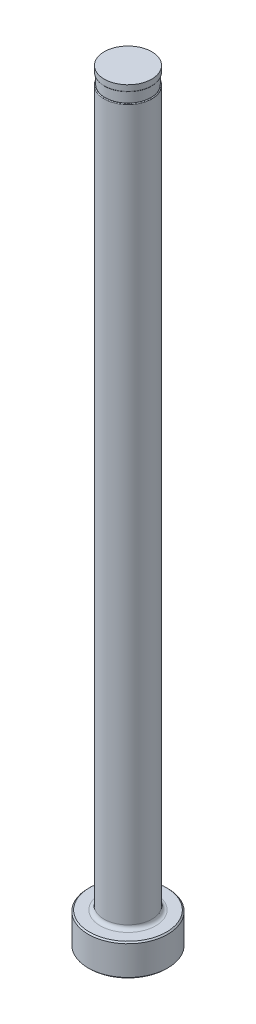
ISO-10303-21;
HEADER;
FILE_DESCRIPTION(('STEP AP214'),'2;1');
FILE_NAME('part.step','',(''),(''),'','','');
FILE_SCHEMA(('AUTOMOTIVE_DESIGN { 1 0 10303 214 1 1 1 1 }'));
ENDSEC;
DATA;
#1=APPLICATION_CONTEXT('core data for automotive mechanical design processes');
#2=APPLICATION_PROTOCOL_DEFINITION('international standard','automotive_design',2000,#1);
#3=PRODUCT_CONTEXT('',#1,'mechanical');
#4=PRODUCT('Part','Part','',(#3));
#5=PRODUCT_RELATED_PRODUCT_CATEGORY('part','',(#4));
#6=PRODUCT_DEFINITION_FORMATION('','',#4);
#7=PRODUCT_DEFINITION_CONTEXT('part definition',#1,'design');
#8=PRODUCT_DEFINITION('design','',#6,#7);
#9=PRODUCT_DEFINITION_SHAPE('','',#8);
#10=(LENGTH_UNIT() NAMED_UNIT(*) SI_UNIT(.MILLI.,.METRE.));
#11=(NAMED_UNIT(*) PLANE_ANGLE_UNIT() SI_UNIT($,.RADIAN.));
#12=(NAMED_UNIT(*) SI_UNIT($,.STERADIAN.) SOLID_ANGLE_UNIT());
#13=UNCERTAINTY_MEASURE_WITH_UNIT(LENGTH_MEASURE(1.E-05),#10,'distance_accuracy_value','');
#14=(GEOMETRIC_REPRESENTATION_CONTEXT(3) GLOBAL_UNCERTAINTY_ASSIGNED_CONTEXT((#13)) GLOBAL_UNIT_ASSIGNED_CONTEXT((#10,
#11,#12)) REPRESENTATION_CONTEXT('',''));
#15=CARTESIAN_POINT('',(0.,0.,0.));
#16=DIRECTION('',(0.,0.,1.));
#17=DIRECTION('',(1.,0.,0.));
#18=AXIS2_PLACEMENT_3D('',#15,#16,#17);
#19=CARTESIAN_POINT('',(-4.76249999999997,151.13,0.));
#20=DIRECTION('',(0.,1.,0.));
#21=DIRECTION('',(0.,0.,1.));
#22=AXIS2_PLACEMENT_3D('',#19,#20,#21);
#23=PLANE('',#22);
#24=CARTESIAN_POINT('',(0.,151.13,0.));
#25=DIRECTION('',(0.,1.,0.));
#26=DIRECTION('',(0.,0.,1.));
#27=AXIS2_PLACEMENT_3D('',#24,#25,#26);
#28=CIRCLE('',#27,4.61644999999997);
#29=CARTESIAN_POINT('',(0.,151.13,4.61644999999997));
#30=VERTEX_POINT('',#29);
#31=EDGE_CURVE('E11',#30,#30,#28,.F.);
#32=ORIENTED_EDGE('',*,*,#31,.T.);
#33=EDGE_LOOP('',(#32));
#34=FACE_BOUND('',#33,.T.);
#35=CARTESIAN_POINT('',(0.,151.13,0.));
#36=DIRECTION('',(0.,1.,0.));
#37=DIRECTION('',(0.,0.,1.));
#38=AXIS2_PLACEMENT_3D('',#35,#36,#37);
#39=CIRCLE('',#38,4.55929999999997);
#40=CARTESIAN_POINT('',(0.,151.13,4.55929999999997));
#41=VERTEX_POINT('',#40);
#42=EDGE_CURVE('E78',#41,#41,#39,.T.);
#43=ORIENTED_EDGE('',*,*,#42,.T.);
#44=EDGE_LOOP('',(#43));
#45=FACE_BOUND('',#44,.T.);
#46=ADVANCED_FACE('F36',(#34,#45),#23,.F.);
#47=CARTESIAN_POINT('',(0.,259.958771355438,0.));
#48=DIRECTION('',(0.,1.,0.));
#49=DIRECTION('',(0.,0.,1.));
#50=AXIS2_PLACEMENT_3D('',#47,#48,#49);
#51=CYLINDRICAL_SURFACE('',#50,4.76249999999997);
#52=DIRECTION('',(0.,1.,0.));
#53=VECTOR('',#52,1.);
#54=CARTESIAN_POINT('',(-4.55929999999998,259.958771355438,-1.37629566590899));
#55=LINE('',#54,#53);
#56=CARTESIAN_POINT('',(-4.55929999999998,148.971,-1.37629566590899));
#57=VERTEX_POINT('',#56);
#58=CARTESIAN_POINT('',(-4.55929999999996,86.614,-1.37629566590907));
#59=VERTEX_POINT('',#58);
#60=EDGE_CURVE('E73',#57,#59,#55,.F.);
#61=ORIENTED_EDGE('',*,*,#60,.F.);
#62=CARTESIAN_POINT('',(0.,148.971,0.));
#63=DIRECTION('',(0.,-1.,0.));
#64=DIRECTION('',(0.,0.,-1.));
#65=AXIS2_PLACEMENT_3D('',#62,#63,#64);
#66=CIRCLE('',#65,4.76249999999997);
#67=CARTESIAN_POINT('',(-4.55929999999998,148.971,1.37629566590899));
#68=VERTEX_POINT('',#67);
#69=EDGE_CURVE('E51',#57,#68,#66,.T.);
#70=ORIENTED_EDGE('',*,*,#69,.T.);
#71=DIRECTION('',(0.,1.,0.));
#72=VECTOR('',#71,1.);
#73=CARTESIAN_POINT('',(-4.55929999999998,259.958771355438,1.37629566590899));
#74=LINE('',#73,#72);
#75=CARTESIAN_POINT('',(-4.55929999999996,86.614,1.37629566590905));
#76=VERTEX_POINT('',#75);
#77=EDGE_CURVE('E84',#76,#68,#74,.T.);
#78=ORIENTED_EDGE('',*,*,#77,.F.);
#79=CARTESIAN_POINT('',(-4.55929999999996,86.614,-1.37629566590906));
#80=CARTESIAN_POINT('',(-4.55929737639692,86.5852402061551,-1.37629775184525));
#81=CARTESIAN_POINT('',(-4.55969127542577,86.5564975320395,-1.37500007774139));
#82=CARTESIAN_POINT('',(-4.56124470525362,86.4992773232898,-1.36984087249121));
#83=CARTESIAN_POINT('',(-4.5624038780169,86.4707996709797,-1.36598054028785));
#84=CARTESIAN_POINT('',(-4.56696801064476,86.3864539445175,-1.35067685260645));
#85=CARTESIAN_POINT('',(-4.5714603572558,86.3312762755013,-1.33550964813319));
#86=CARTESIAN_POINT('',(-4.58280020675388,86.2246988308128,-1.29605614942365));
#87=CARTESIAN_POINT('',(-4.58964466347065,86.1732942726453,-1.27178164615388));
#88=CARTESIAN_POINT('',(-4.60493832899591,86.0753127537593,-1.2152383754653));
#89=CARTESIAN_POINT('',(-4.61338924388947,86.0287410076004,-1.18296109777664));
#90=CARTESIAN_POINT('',(-4.63119432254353,85.9406407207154,-1.11122717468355));
#91=CARTESIAN_POINT('',(-4.64055936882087,85.8991909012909,-1.07167734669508));
#92=CARTESIAN_POINT('',(-4.65929799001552,85.8224511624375,-0.987030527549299));
#93=CARTESIAN_POINT('',(-4.66867156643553,85.7871627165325,-0.941932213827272));
#94=CARTESIAN_POINT('',(-4.68829944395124,85.7173161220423,-0.839298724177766));
#95=CARTESIAN_POINT('',(-4.69843056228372,85.6839130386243,-0.780955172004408));
#96=CARTESIAN_POINT('',(-4.71694909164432,85.6254876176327,-0.659965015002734));
#97=CARTESIAN_POINT('',(-4.72533534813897,85.6004708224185,-0.597315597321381));
#98=CARTESIAN_POINT('',(-4.74110178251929,85.5547147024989,-0.457354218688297));
#99=CARTESIAN_POINT('',(-4.74801655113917,85.5355974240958,-0.379457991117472));
#100=CARTESIAN_POINT('',(-4.75800499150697,85.5083334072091,-0.221524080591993));
#101=CARTESIAN_POINT('',(-4.76107621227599,85.500193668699,-0.141485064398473));
#102=CARTESIAN_POINT('',(-4.76327668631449,85.4943271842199,0.0299431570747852));
#103=CARTESIAN_POINT('',(-4.76181415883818,85.4981641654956,0.121398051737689));
#104=CARTESIAN_POINT('',(-4.75374911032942,85.5198915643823,0.302489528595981));
#105=CARTESIAN_POINT('',(-4.74714208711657,85.5377942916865,0.392124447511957));
#106=CARTESIAN_POINT('',(-4.72930079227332,85.5886459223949,0.568426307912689));
#107=CARTESIAN_POINT('',(-4.71798291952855,85.6218679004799,0.655007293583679));
#108=CARTESIAN_POINT('',(-4.69215822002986,85.7041393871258,0.819736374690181));
#109=CARTESIAN_POINT('',(-4.67765906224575,85.7531509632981,0.897904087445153));
#110=CARTESIAN_POINT('',(-4.65260917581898,85.8488873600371,1.01840460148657));
#111=CARTESIAN_POINT('',(-4.642278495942,85.8913315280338,1.06420330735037));
#112=CARTESIAN_POINT('',(-4.62221244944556,85.9833278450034,1.14822353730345));
#113=CARTESIAN_POINT('',(-4.61247679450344,86.0328765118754,1.18644875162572));
#114=CARTESIAN_POINT('',(-4.59462030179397,86.1386759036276,1.2538357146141));
#115=CARTESIAN_POINT('',(-4.58651300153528,86.1949770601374,1.28292253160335));
#116=CARTESIAN_POINT('',(-4.57311393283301,86.312357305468,1.3299034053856));
#117=CARTESIAN_POINT('',(-4.56781667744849,86.373426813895,1.34781928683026));
#118=CARTESIAN_POINT('',(-4.56265822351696,86.4650432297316,1.36513201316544));
#119=CARTESIAN_POINT('',(-4.5614036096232,86.4946738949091,1.36931216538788));
#120=CARTESIAN_POINT('',(-4.55972347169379,86.5541961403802,1.37489368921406));
#121=CARTESIAN_POINT('',(-4.55929732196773,86.584087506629,1.37629715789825));
#122=CARTESIAN_POINT('',(-4.55929999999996,86.614,1.37629566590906));
#123=B_SPLINE_CURVE_WITH_KNOTS('',3,(#79,#80,#81,#82,#83,#84,#85,#86,#87,#88,#89,#90,#91,#92,
#93,#94,#95,#96,#97,#98,#99,#100,#101,#102,#103,#104,#105,#106,#107,#108,#109,#110,#111,#112,
#113,#114,#115,#116,#117,#118,#119,#120,#121,#122),.UNSPECIFIED.,.F.,.F.,(4,2,2,2,2,2,2,2,2,2,2,
2,2,2,2,2,2,2,2,2,2,4),(0.,0.086214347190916,0.172388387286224,0.343564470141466,
0.514519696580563,0.685657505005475,0.859163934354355,1.03271180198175,1.23591349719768,
1.43924922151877,1.67981780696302,1.92053972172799,2.1939427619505,2.4675853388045,
2.74630643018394,3.02436286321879,3.21350217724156,3.40254910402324,3.59310796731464,
3.78329335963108,3.87302183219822,3.9626825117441),.UNSPECIFIED.);
#124=EDGE_CURVE('E81',#59,#76,#123,.T.);
#125=ORIENTED_EDGE('',*,*,#124,.F.);
#126=EDGE_LOOP('',(#61,#70,#78,#125));
#127=FACE_BOUND('',#126,.T.);
#128=CARTESIAN_POINT('',(0.,7.11200000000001,0.));
#129=DIRECTION('',(0.,1.,0.));
#130=DIRECTION('',(0.,0.,1.));
#131=AXIS2_PLACEMENT_3D('',#128,#129,#130);
#132=CIRCLE('',#131,4.76249999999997);
#133=CARTESIAN_POINT('',(0.,7.11200000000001,4.76249999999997));
#134=VERTEX_POINT('',#133);
#135=EDGE_CURVE('E116',#134,#134,#132,.T.);
#136=ORIENTED_EDGE('',*,*,#135,.T.);
#137=EDGE_LOOP('',(#136));
#138=FACE_BOUND('',#137,.T.);
#139=ADVANCED_FACE('F82',(#127,#138),#51,.T.);
#140=CARTESIAN_POINT('',(0.,0.,0.));
#141=DIRECTION('',(0.,-1.,0.));
#142=DIRECTION('',(0.,0.,-1.));
#143=AXIS2_PLACEMENT_3D('',#140,#141,#142);
#144=PLANE('',#143);
#145=CARTESIAN_POINT('',(0.,0.,0.));
#146=DIRECTION('',(0.,-1.,0.));
#147=DIRECTION('',(0.,0.,-1.));
#148=AXIS2_PLACEMENT_3D('',#145,#146,#147);
#149=CIRCLE('',#148,7.68349999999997);
#150=CARTESIAN_POINT('',(0.,0.,-7.68349999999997));
#151=VERTEX_POINT('',#150);
#152=EDGE_CURVE('E113',#151,#151,#149,.T.);
#153=ORIENTED_EDGE('',*,*,#152,.T.);
#154=EDGE_LOOP('',(#153));
#155=FACE_BOUND('',#154,.T.);
#156=ADVANCED_FACE('F192',(#155),#144,.T.);
#157=CARTESIAN_POINT('',(0.,259.958771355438,0.));
#158=DIRECTION('',(0.,1.,0.));
#159=DIRECTION('',(0.,0.,1.));
#160=AXIS2_PLACEMENT_3D('',#157,#158,#159);
#161=CYLINDRICAL_SURFACE('',#160,7.93749999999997);
#162=CARTESIAN_POINT('',(0.,6.09600000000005,0.));
#163=DIRECTION('',(0.,1.,0.));
#164=DIRECTION('',(0.,0.,1.));
#165=AXIS2_PLACEMENT_3D('',#162,#163,#164);
#166=CIRCLE('',#165,7.93749999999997);
#167=CARTESIAN_POINT('',(0.,6.09600000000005,7.93749999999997));
#168=VERTEX_POINT('',#167);
#169=EDGE_CURVE('E110',#168,#168,#166,.F.);
#170=ORIENTED_EDGE('',*,*,#169,.T.);
#171=EDGE_LOOP('',(#170));
#172=FACE_BOUND('',#171,.T.);
#173=CARTESIAN_POINT('',(0.,0.253999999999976,0.));
#174=DIRECTION('',(0.,-1.,0.));
#175=DIRECTION('',(0.,0.,-1.));
#176=AXIS2_PLACEMENT_3D('',#173,#174,#175);
#177=CIRCLE('',#176,7.93749999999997);
#178=CARTESIAN_POINT('',(0.,0.253999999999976,-7.93749999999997));
#179=VERTEX_POINT('',#178);
#180=EDGE_CURVE('E107',#179,#179,#177,.F.);
#181=ORIENTED_EDGE('',*,*,#180,.T.);
#182=EDGE_LOOP('',(#181));
#183=FACE_BOUND('',#182,.T.);
#184=ADVANCED_FACE('F195',(#172,#183),#161,.T.);
#185=CARTESIAN_POINT('',(-7.93749999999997,6.35,0.));
#186=DIRECTION('',(0.,1.,0.));
#187=DIRECTION('',(0.,0.,1.));
#188=AXIS2_PLACEMENT_3D('',#185,#186,#187);
#189=PLANE('',#188);
#190=CARTESIAN_POINT('',(0.,6.35,0.));
#191=DIRECTION('',(0.,1.,0.));
#192=DIRECTION('',(0.,0.,1.));
#193=AXIS2_PLACEMENT_3D('',#190,#191,#192);
#194=CIRCLE('',#193,5.52449999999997);
#195=CARTESIAN_POINT('',(0.,6.35,5.52449999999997));
#196=VERTEX_POINT('',#195);
#197=EDGE_CURVE('E87',#196,#196,#194,.F.);
#198=ORIENTED_EDGE('',*,*,#197,.T.);
#199=EDGE_LOOP('',(#198));
#200=FACE_BOUND('',#199,.T.);
#201=CARTESIAN_POINT('',(0.,6.35,0.));
#202=DIRECTION('',(0.,1.,0.));
#203=DIRECTION('',(0.,0.,1.));
#204=AXIS2_PLACEMENT_3D('',#201,#202,#203);
#205=CIRCLE('',#204,7.68350000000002);
#206=CARTESIAN_POINT('',(0.,6.35,7.68350000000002));
#207=VERTEX_POINT('',#206);
#208=EDGE_CURVE('E104',#207,#207,#205,.T.);
#209=ORIENTED_EDGE('',*,*,#208,.T.);
#210=EDGE_LOOP('',(#209));
#211=FACE_BOUND('',#210,.T.);
#212=ADVANCED_FACE('F190',(#200,#211),#189,.T.);
#213=CARTESIAN_POINT('',(0.,6.35000000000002,0.));
#214=DIRECTION('',(0.,-1.,0.));
#215=DIRECTION('',(0.,0.,-1.));
#216=AXIS2_PLACEMENT_3D('',#213,#214,#215);
#217=CONICAL_SURFACE('',#216,7.6835,0.785398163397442);
#218=ORIENTED_EDGE('',*,*,#169,.F.);
#219=EDGE_LOOP('',(#218));
#220=FACE_BOUND('',#219,.T.);
#221=ORIENTED_EDGE('',*,*,#208,.F.);
#222=EDGE_LOOP('',(#221));
#223=FACE_BOUND('',#222,.T.);
#224=ADVANCED_FACE('F186',(#220,#223),#217,.T.);
#225=CARTESIAN_POINT('',(0.,0.253999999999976,0.));
#226=DIRECTION('',(0.,1.,0.));
#227=DIRECTION('',(0.,0.,1.));
#228=AXIS2_PLACEMENT_3D('',#225,#226,#227);
#229=CONICAL_SURFACE('',#228,7.93749999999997,0.785398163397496);
#230=ORIENTED_EDGE('',*,*,#152,.F.);
#231=EDGE_LOOP('',(#230));
#232=FACE_BOUND('',#231,.T.);
#233=ORIENTED_EDGE('',*,*,#180,.F.);
#234=EDGE_LOOP('',(#233));
#235=FACE_BOUND('',#234,.T.);
#236=ADVANCED_FACE('F182',(#232,#235),#229,.T.);
#237=CARTESIAN_POINT('',(0.,7.11200000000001,0.));
#238=DIRECTION('',(0.,1.,0.));
#239=DIRECTION('',(0.,0.,1.));
#240=AXIS2_PLACEMENT_3D('',#237,#238,#239);
#241=TOROIDAL_SURFACE('',#240,5.52449999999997,0.762);
#242=ORIENTED_EDGE('',*,*,#197,.F.);
#243=EDGE_LOOP('',(#242));
#244=FACE_BOUND('',#243,.T.);
#245=ORIENTED_EDGE('',*,*,#135,.F.);
#246=EDGE_LOOP('',(#245));
#247=FACE_BOUND('',#246,.T.);
#248=ADVANCED_FACE('F147',(#244,#247),#241,.F.);
#249=CARTESIAN_POINT('',(-4.76249999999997,149.098,0.));
#250=DIRECTION('',(0.,-1.,0.));
#251=DIRECTION('',(0.,0.,-1.));
#252=AXIS2_PLACEMENT_3D('',#249,#250,#251);
#253=PLANE('',#252);
#254=DIRECTION('',(0.,0.,1.));
#255=VECTOR('',#254,1.);
#256=CARTESIAN_POINT('',(-4.55929999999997,149.098,0.));
#257=LINE('',#256,#255);
#258=CARTESIAN_POINT('',(-4.55929999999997,149.098,0.));
#259=VERTEX_POINT('',#258);
#260=CARTESIAN_POINT('',(-4.55929999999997,149.098,0.837044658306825));
#261=VERTEX_POINT('',#260);
#262=EDGE_CURVE('E90',#259,#261,#257,.T.);
#263=ORIENTED_EDGE('',*,*,#262,.T.);
#264=CARTESIAN_POINT('',(0.,149.098,0.));
#265=DIRECTION('',(0.,-1.,0.));
#266=DIRECTION('',(0.,0.,-1.));
#267=AXIS2_PLACEMENT_3D('',#264,#265,#266);
#268=CIRCLE('',#267,4.63549999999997);
#269=CARTESIAN_POINT('',(-4.55929999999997,149.098,-0.837044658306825));
#270=VERTEX_POINT('',#269);
#271=EDGE_CURVE('E86',#261,#270,#268,.F.);
#272=ORIENTED_EDGE('',*,*,#271,.T.);
#273=EDGE_CURVE('E79',#270,#259,#257,.T.);
#274=ORIENTED_EDGE('',*,*,#273,.T.);
#275=CARTESIAN_POINT('',(0.,149.098,0.));
#276=DIRECTION('',(0.,1.,0.));
#277=DIRECTION('',(0.,0.,1.));
#278=AXIS2_PLACEMENT_3D('',#275,#276,#277);
#279=CIRCLE('',#278,4.55929999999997);
#280=EDGE_CURVE('E101',#259,#259,#279,.T.);
#281=ORIENTED_EDGE('',*,*,#280,.F.);
#282=EDGE_LOOP('',(#263,#272,#274,#281));
#283=FACE_BOUND('',#282,.T.);
#284=ADVANCED_FACE('F144',(#283),#253,.F.);
#285=CARTESIAN_POINT('',(0.,153.448281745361,0.));
#286=DIRECTION('',(0.,1.,0.));
#287=DIRECTION('',(0.,0.,1.));
#288=AXIS2_PLACEMENT_3D('',#285,#286,#287);
#289=CYLINDRICAL_SURFACE('',#288,4.55929999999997);
#290=ORIENTED_EDGE('',*,*,#42,.F.);
#291=EDGE_LOOP('',(#290));
#292=FACE_BOUND('',#291,.T.);
#293=ORIENTED_EDGE('',*,*,#280,.T.);
#294=EDGE_LOOP('',(#293));
#295=FACE_BOUND('',#294,.T.);
#296=ADVANCED_FACE('F141',(#292,#295),#289,.T.);
#297=CARTESIAN_POINT('',(-4.55929999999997,150.114,-7.93749999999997));
#298=DIRECTION('',(1.,0.,0.));
#299=DIRECTION('',(0.,1.,0.));
#300=AXIS2_PLACEMENT_3D('',#297,#298,#299);
#301=PLANE('',#300);
#302=ORIENTED_EDGE('',*,*,#273,.F.);
#303=CARTESIAN_POINT('',(-4.55929999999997,149.098,-0.837044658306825));
#304=CARTESIAN_POINT('',(-4.55929999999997,149.097996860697,-0.858041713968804));
#305=CARTESIAN_POINT('',(-4.55929999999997,149.097829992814,-0.879040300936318));
#306=CARTESIAN_POINT('',(-4.55929999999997,149.097073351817,-0.921044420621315));
#307=CARTESIAN_POINT('',(-4.55929999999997,149.096483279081,-0.942049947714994));
#308=CARTESIAN_POINT('',(-4.55929999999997,149.094769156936,-0.984421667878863));
#309=CARTESIAN_POINT('',(-4.55929999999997,149.093635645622,-1.00578751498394));
#310=CARTESIAN_POINT('',(-4.55929999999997,149.090687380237,-1.04846310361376));
#311=CARTESIAN_POINT('',(-4.55929999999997,149.088872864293,-1.06977286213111));
#312=CARTESIAN_POINT('',(-4.55929999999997,149.083360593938,-1.12201635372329));
#313=CARTESIAN_POINT('',(-4.55929999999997,149.079181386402,-1.15290757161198));
#314=CARTESIAN_POINT('',(-4.55929999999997,149.070757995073,-1.19875333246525));
#315=CARTESIAN_POINT('',(-4.55929999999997,149.067604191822,-1.21390713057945));
#316=CARTESIAN_POINT('',(-4.55929999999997,149.06032624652,-1.24397628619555));
#317=CARTESIAN_POINT('',(-4.55929999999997,149.056203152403,-1.25889188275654));
#318=CARTESIAN_POINT('',(-4.55929999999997,149.049136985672,-1.28034672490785));
#319=CARTESIAN_POINT('',(-4.55929999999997,149.046754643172,-1.28707008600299));
#320=CARTESIAN_POINT('',(-4.55929999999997,149.041598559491,-1.30038917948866));
#321=CARTESIAN_POINT('',(-4.55929999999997,149.038823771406,-1.30698451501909));
#322=CARTESIAN_POINT('',(-4.55929999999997,149.032425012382,-1.32070015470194));
#323=CARTESIAN_POINT('',(-4.55929999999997,149.028739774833,-1.32779211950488));
#324=CARTESIAN_POINT('',(-4.55929999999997,149.020505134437,-1.34145187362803));
#325=CARTESIAN_POINT('',(-4.55929999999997,149.015959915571,-1.34802199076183));
#326=CARTESIAN_POINT('',(-4.55929999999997,149.008707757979,-1.3564128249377));
#327=CARTESIAN_POINT('',(-4.55929999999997,149.006550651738,-1.35870356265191));
#328=CARTESIAN_POINT('',(-4.55929999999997,149.001986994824,-1.36303580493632));
#329=CARTESIAN_POINT('',(-4.55929999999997,148.999580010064,-1.36507686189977));
#330=CARTESIAN_POINT('',(-4.55929999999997,148.994447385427,-1.36882028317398));
#331=CARTESIAN_POINT('',(-4.55929999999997,148.99171711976,-1.37051646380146));
#332=CARTESIAN_POINT('',(-4.55929999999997,148.985982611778,-1.37333747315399));
#333=CARTESIAN_POINT('',(-4.55929999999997,148.982980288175,-1.37446598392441));
#334=CARTESIAN_POINT('',(-4.55929999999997,148.978439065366,-1.37556999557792));
#335=CARTESIAN_POINT('',(-4.55929999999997,148.976969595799,-1.37583954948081));
#336=CARTESIAN_POINT('',(-4.55929999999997,148.974000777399,-1.37620343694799));
#337=CARTESIAN_POINT('',(-4.55929999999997,148.972501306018,-1.3762967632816));
#338=CARTESIAN_POINT('',(-4.55929999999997,148.971,-1.37629566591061));
#339=B_SPLINE_CURVE_WITH_KNOTS('',3,(#303,#304,#305,#306,#307,#308,#309,#310,#311,#312,#313,
#314,#315,#316,#317,#318,#319,#320,#321,#322,#323,#324,#325,#326,#327,#328,#329,#330,#331,#332,
#333,#334,#335,#336,#337,#338),.UNSPECIFIED.,.F.,.F.,(4,2,2,2,2,2,2,2,2,2,2,2,2,2,2,2,2,4),(0.,
0.0629926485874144,0.126029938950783,0.190207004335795,0.254361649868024,0.347770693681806,
0.394187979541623,0.440555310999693,0.461946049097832,0.483394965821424,0.507342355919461,
0.531176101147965,0.540601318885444,0.550043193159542,0.559641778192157,0.56917727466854,
0.573649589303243,0.578147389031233),.UNSPECIFIED.);
#340=EDGE_CURVE('E59',#270,#57,#339,.T.);
#341=ORIENTED_EDGE('',*,*,#340,.T.);
#342=ORIENTED_EDGE('',*,*,#60,.T.);
#343=DIRECTION('',(0.,0.,1.));
#344=VECTOR('',#343,1.);
#345=CARTESIAN_POINT('',(-4.55929999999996,86.614,-7.93749999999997));
#346=LINE('',#345,#344);
#347=EDGE_CURVE('E77',#59,#76,#346,.T.);
#348=ORIENTED_EDGE('',*,*,#347,.T.);
#349=ORIENTED_EDGE('',*,*,#77,.T.);
#350=CARTESIAN_POINT('',(-4.55929999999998,148.971,1.37629566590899));
#351=CARTESIAN_POINT('',(-4.55929999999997,148.973444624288,1.3763038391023));
#352=CARTESIAN_POINT('',(-4.55929999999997,148.975877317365,1.37605183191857));
#353=CARTESIAN_POINT('',(-4.55929999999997,148.980619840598,1.37510642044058));
#354=CARTESIAN_POINT('',(-4.55929999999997,148.982930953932,1.37441958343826));
#355=CARTESIAN_POINT('',(-4.55929999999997,148.987943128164,1.37247105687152));
#356=CARTESIAN_POINT('',(-4.55929999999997,148.990605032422,1.3711110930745));
#357=CARTESIAN_POINT('',(-4.55929999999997,148.995689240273,1.36798215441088));
#358=CARTESIAN_POINT('',(-4.55929999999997,148.998109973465,1.36621072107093));
#359=CARTESIAN_POINT('',(-4.55929999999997,149.004401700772,1.36098866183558));
#360=CARTESIAN_POINT('',(-4.55929999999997,149.0080371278,1.35725807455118));
#361=CARTESIAN_POINT('',(-4.55929999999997,149.014750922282,1.34933701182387));
#362=CARTESIAN_POINT('',(-4.55929999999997,149.017828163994,1.34514563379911));
#363=CARTESIAN_POINT('',(-4.55929999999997,149.029141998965,1.32813171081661));
#364=CARTESIAN_POINT('',(-4.55929999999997,149.035833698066,1.31430846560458));
#365=CARTESIAN_POINT('',(-4.55929999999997,149.047426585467,1.28593719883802));
#366=CARTESIAN_POINT('',(-4.55929999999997,149.052315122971,1.27138484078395));
#367=CARTESIAN_POINT('',(-4.55929999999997,149.060580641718,1.24300288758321));
#368=CARTESIAN_POINT('',(-4.55929999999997,149.064042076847,1.22919836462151));
#369=CARTESIAN_POINT('',(-4.55929999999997,149.070216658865,1.20142059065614));
#370=CARTESIAN_POINT('',(-4.55929999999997,149.072929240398,1.18744722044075));
#371=CARTESIAN_POINT('',(-4.55929999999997,149.080216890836,1.14532367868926));
#372=CARTESIAN_POINT('',(-4.55929999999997,149.08392779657,1.11702450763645));
#373=CARTESIAN_POINT('',(-4.55929999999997,149.089831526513,1.06027711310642));
#374=CARTESIAN_POINT('',(-4.55929999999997,149.092023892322,1.031828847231));
#375=CARTESIAN_POINT('',(-4.55929999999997,149.095305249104,0.974900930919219));
#376=CARTESIAN_POINT('',(-4.55929999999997,149.096395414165,0.946421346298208));
#377=CARTESIAN_POINT('',(-4.55929999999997,149.097399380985,0.904435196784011));
#378=CARTESIAN_POINT('',(-4.55929999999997,149.097630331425,0.890934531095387));
#379=CARTESIAN_POINT('',(-4.55929999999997,149.097930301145,0.863970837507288));
#380=CARTESIAN_POINT('',(-4.55929999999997,149.097999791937,0.85050781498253));
#381=CARTESIAN_POINT('',(-4.55929999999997,149.098,0.837044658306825));
#382=B_SPLINE_CURVE_WITH_KNOTS('',3,(#350,#351,#352,#353,#354,#355,#356,#357,#358,#359,#360,
#361,#362,#363,#364,#365,#366,#367,#368,#369,#370,#371,#372,#373,#374,#375,#376,#377,#378,#379,
#380,#381),.UNSPECIFIED.,.F.,.F.,(4,2,2,2,2,2,2,2,2,2,2,2,2,2,2,4),(0.,0.00730179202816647,
0.0144958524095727,0.0234127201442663,0.0323843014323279,0.0479233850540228,0.0634934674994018,
0.109206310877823,0.155234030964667,0.197892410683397,0.240582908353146,0.32613198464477,
0.411706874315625,0.497190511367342,0.537697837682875,0.578086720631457),.UNSPECIFIED.);
#383=EDGE_CURVE('E172',#68,#261,#382,.T.);
#384=ORIENTED_EDGE('',*,*,#383,.T.);
#385=ORIENTED_EDGE('',*,*,#262,.F.);
#386=EDGE_LOOP('',(#302,#341,#342,#348,#349,#384,#385));
#387=FACE_BOUND('',#386,.T.);
#388=ADVANCED_FACE('F75',(#387),#301,.F.);
#389=CARTESIAN_POINT('',(-7.73429999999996,86.614,-7.93749999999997));
#390=DIRECTION('',(0.,0.,1.));
#391=DIRECTION('',(1.,0.,0.));
#392=AXIS2_PLACEMENT_3D('',#389,#390,#391);
#393=CYLINDRICAL_SURFACE('',#392,3.175);
#394=ORIENTED_EDGE('',*,*,#347,.F.);
#395=ORIENTED_EDGE('',*,*,#124,.T.);
#396=EDGE_LOOP('',(#394,#395));
#397=FACE_BOUND('',#396,.T.);
#398=ADVANCED_FACE('F89',(#397),#393,.F.);
#399=CARTESIAN_POINT('',(0.,152.687735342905,0.));
#400=DIRECTION('',(0.,1.,0.));
#401=DIRECTION('',(0.,0.,1.));
#402=AXIS2_PLACEMENT_3D('',#399,#400,#401);
#403=CYLINDRICAL_SURFACE('',#402,4.74344999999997);
#404=CARTESIAN_POINT('',(0.,151.257,0.));
#405=DIRECTION('',(0.,1.,0.));
#406=DIRECTION('',(0.,0.,1.));
#407=AXIS2_PLACEMENT_3D('',#404,#405,#406);
#408=CIRCLE('',#407,4.74344999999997);
#409=CARTESIAN_POINT('',(0.,151.257,4.74344999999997));
#410=VERTEX_POINT('',#409);
#411=EDGE_CURVE('E44',#410,#410,#408,.T.);
#412=ORIENTED_EDGE('',*,*,#411,.T.);
#413=EDGE_LOOP('',(#412));
#414=FACE_BOUND('',#413,.T.);
#415=CARTESIAN_POINT('',(0.,152.4,0.));
#416=DIRECTION('',(0.,1.,0.));
#417=DIRECTION('',(0.,0.,1.));
#418=AXIS2_PLACEMENT_3D('',#415,#416,#417);
#419=CIRCLE('',#418,4.74344999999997);
#420=CARTESIAN_POINT('',(0.,152.4,4.74344999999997));
#421=VERTEX_POINT('',#420);
#422=EDGE_CURVE('E91',#421,#421,#419,.T.);
#423=ORIENTED_EDGE('',*,*,#422,.F.);
#424=EDGE_LOOP('',(#423));
#425=FACE_BOUND('',#424,.T.);
#426=ADVANCED_FACE('F135',(#414,#425),#403,.T.);
#427=CARTESIAN_POINT('',(-4.76249999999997,152.4,0.));
#428=DIRECTION('',(0.,1.,0.));
#429=DIRECTION('',(0.,0.,1.));
#430=AXIS2_PLACEMENT_3D('',#427,#428,#429);
#431=PLANE('',#430);
#432=ORIENTED_EDGE('',*,*,#422,.T.);
#433=EDGE_LOOP('',(#432));
#434=FACE_BOUND('',#433,.T.);
#435=ADVANCED_FACE('F149',(#434),#431,.T.);
#436=CARTESIAN_POINT('',(0.,148.971,0.));
#437=DIRECTION('',(0.,-1.,0.));
#438=DIRECTION('',(0.,0.,-1.));
#439=AXIS2_PLACEMENT_3D('',#436,#437,#438);
#440=TOROIDAL_SURFACE('',#439,4.63549999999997,0.127);
#441=ORIENTED_EDGE('',*,*,#383,.F.);
#442=ORIENTED_EDGE('',*,*,#69,.F.);
#443=ORIENTED_EDGE('',*,*,#340,.F.);
#444=ORIENTED_EDGE('',*,*,#271,.F.);
#445=EDGE_LOOP('',(#441,#442,#443,#444));
#446=FACE_BOUND('',#445,.T.);
#447=ADVANCED_FACE('F151',(#446),#440,.T.);
#448=CARTESIAN_POINT('',(0.,151.257,0.));
#449=DIRECTION('',(0.,1.,0.));
#450=DIRECTION('',(0.,0.,1.));
#451=AXIS2_PLACEMENT_3D('',#448,#449,#450);
#452=TOROIDAL_SURFACE('',#451,4.61644999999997,0.127);
#453=ORIENTED_EDGE('',*,*,#31,.F.);
#454=EDGE_LOOP('',(#453));
#455=FACE_BOUND('',#454,.T.);
#456=ORIENTED_EDGE('',*,*,#411,.F.);
#457=EDGE_LOOP('',(#456));
#458=FACE_BOUND('',#457,.T.);
#459=ADVANCED_FACE('F38',(#455,#458),#452,.T.);
#460=CLOSED_SHELL('',(#46,#139,#156,#184,#212,#224,#236,#248,#284,#296,#388,#398,#426,#435,#447,#459));
#461=MANIFOLD_SOLID_BREP('B2',#460);
#462=ADVANCED_BREP_SHAPE_REPRESENTATION('',(#18,#461),#14);
#463=SHAPE_DEFINITION_REPRESENTATION(#9,#462);
ENDSEC;
END-ISO-10303-21;
